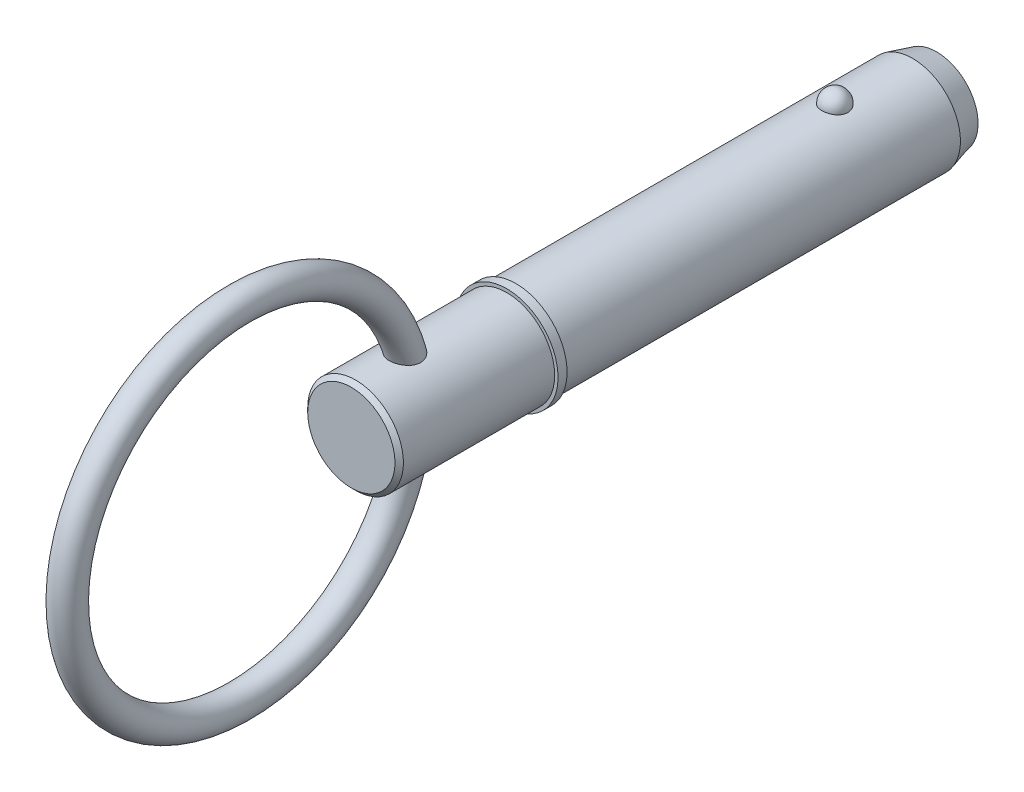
from build123d import *

# Parameters (mm, degrees)
SKETCH2_R           = 7.94
BOSS_EXTRUDE1_DEPTH = 50.8
BOSS_EXTRUDE2_START = 19.05
SKETCH3_R           = 7.94
BOSS_EXTRUDE2_DEPTH = 19.05
CHAMFER1_SIZE       = 4
CHAMFER1_SIZE2      = 1.07179677
SKETCH20_W          = 1.5
SKETCH20_H          = 8.5
SKETCH21_R          = 7.94
BOSS_EXTRUDE3_DEPTH = 27.31
CHAMFER2_SIZE       = 0.7
SKETCH24_R          = 2.5


with BuildPart() as part:
    # Sketch2 → Boss-Extrude1 (new body)
    with BuildSketch(Plane.XY):
        Circle(SKETCH2_R)
    extrude(amount=BOSS_EXTRUDE1_DEPTH)

    # Sketch3 → Boss-Extrude2 (add)
    with BuildSketch(Plane(origin=(0, 0, 0), x_dir=(-1, 0, 0), z_dir=(0, 0, -1)).offset(BOSS_EXTRUDE2_START)):
        Circle(SKETCH3_R)
    extrude(amount=-BOSS_EXTRUDE2_DEPTH)

    # Chamfer1
    chamfer1_edges = [part.edges().sort_by_distance(p)[0] for p in [
        (7.94, 0, -19.05),
    ]]
    chamfer1_side = [part.faces().sort_by_distance(p)[0] for p in [
        (7.94, 0, -9.525),
    ]]
    chamfer(chamfer1_edges, length=CHAMFER1_SIZE, length2=CHAMFER1_SIZE2, reference=chamfer1_side[0])

    # Sketch18 → Revolve1 (revolve)
    with BuildSketch(Plane(origin=(0, 0, 0), x_dir=(0, 0, -1), z_dir=(1, 0, 0))):
        with BuildLine():
            Line((2.15, 10.09), (2.15, 5.79))
            ThreePointArc((2.15, 5.79), (0, 7.94), (2.15, 10.09))
        make_face()
    revolve(axis=Axis((0, 10.09, -2.15), (0, -1, 0)))

    # Sketch20 → Revolve2 (revolve)
    with BuildSketch(Plane(origin=(0, 0, 0), x_dir=(0, 0, -1), z_dir=(1, 0, 0)), mode=Mode.PRIVATE) as revolve2_sk:
        with Locations((-51.55, 4.25)):
            Rectangle(SKETCH20_W, SKETCH20_H)
    revolve(revolve2_sk.sketch.rotate(Axis((0, 0, 33.728787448), (0, 0, 1)), 90), axis=Axis((0, 0, 33.728787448), (0, 0, 1)))

    # Sketch21 → Boss-Extrude3 (add)
    with BuildSketch(Plane(origin=(0, 0, 50.8), x_dir=(-1, 0, 0), z_dir=(0, 0, -1))):
        Circle(SKETCH21_R)
    extrude(amount=-BOSS_EXTRUDE3_DEPTH)

    # Chamfer2
    chamfer2_edges = [part.edges().sort_by_distance(p)[0] for p in [
        (7.94, 0, 78.11),
    ]]
    chamfer(chamfer2_edges, length=CHAMFER2_SIZE)

    # Sweep1: sweep along a path in Sketch23
    with BuildLine(Plane(origin=(0, 0, 0), x_dir=(0, 0, -1), z_dir=(1, 0, 0))) as sweep1_path:
        CenterArc((-96.685, 0), 28.575, 0, 360)
    # Sketch24 → Sweep1 (sweep)
    with BuildSketch(Plane(origin=(0, 0, 0), x_dir=(1, 0, 0), z_dir=(0, 1, 0))):
        with Locations((0, -68.11)):
            Circle(SKETCH24_R)
    sweep(path=sweep1_path.line)


solid = part.part
